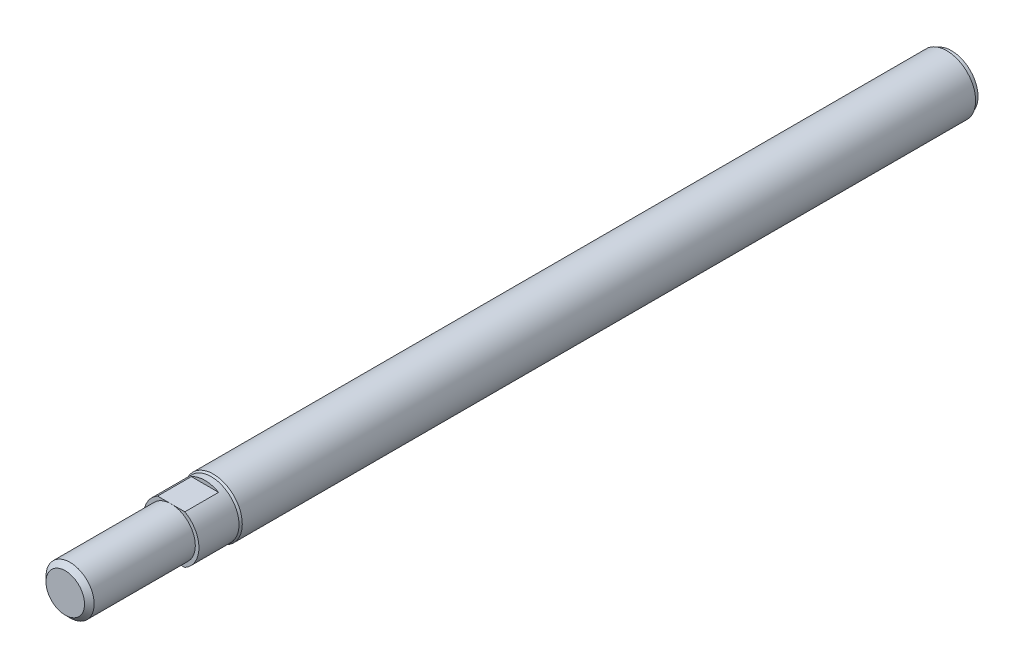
ISO-10303-21;
HEADER;
FILE_DESCRIPTION(('STEP AP214'),'2;1');
FILE_NAME('part.step','',(''),(''),'','','');
FILE_SCHEMA(('AUTOMOTIVE_DESIGN { 1 0 10303 214 1 1 1 1 }'));
ENDSEC;
DATA;
#1=APPLICATION_CONTEXT('core data for automotive mechanical design processes');
#2=APPLICATION_PROTOCOL_DEFINITION('international standard','automotive_design',2000,#1);
#3=PRODUCT_CONTEXT('',#1,'mechanical');
#4=PRODUCT('Part','Part','',(#3));
#5=PRODUCT_RELATED_PRODUCT_CATEGORY('part','',(#4));
#6=PRODUCT_DEFINITION_FORMATION('','',#4);
#7=PRODUCT_DEFINITION_CONTEXT('part definition',#1,'design');
#8=PRODUCT_DEFINITION('design','',#6,#7);
#9=PRODUCT_DEFINITION_SHAPE('','',#8);
#10=(LENGTH_UNIT() NAMED_UNIT(*) SI_UNIT(.MILLI.,.METRE.));
#11=(NAMED_UNIT(*) PLANE_ANGLE_UNIT() SI_UNIT($,.RADIAN.));
#12=(NAMED_UNIT(*) SI_UNIT($,.STERADIAN.) SOLID_ANGLE_UNIT());
#13=UNCERTAINTY_MEASURE_WITH_UNIT(LENGTH_MEASURE(1.E-05),#10,'distance_accuracy_value','');
#14=(GEOMETRIC_REPRESENTATION_CONTEXT(3) GLOBAL_UNCERTAINTY_ASSIGNED_CONTEXT((#13)) GLOBAL_UNIT_ASSIGNED_CONTEXT((#10,
#11,#12)) REPRESENTATION_CONTEXT('',''));
#15=CARTESIAN_POINT('',(0.,0.,0.));
#16=DIRECTION('',(0.,0.,1.));
#17=DIRECTION('',(1.,0.,0.));
#18=AXIS2_PLACEMENT_3D('',#15,#16,#17);
#19=CARTESIAN_POINT('',(0.,0.,184.));
#20=DIRECTION('',(0.,0.,-1.));
#21=DIRECTION('',(-1.,0.,0.));
#22=AXIS2_PLACEMENT_3D('',#19,#20,#21);
#23=CYLINDRICAL_SURFACE('',#22,6.);
#24=CARTESIAN_POINT('',(0.,0.,153.25));
#25=DIRECTION('',(0.,0.,1.));
#26=DIRECTION('',(1.,0.,0.));
#27=AXIS2_PLACEMENT_3D('',#24,#25,#26);
#28=CIRCLE('',#27,6.);
#29=CARTESIAN_POINT('',(6.,0.,153.25));
#30=VERTEX_POINT('',#29);
#31=EDGE_CURVE('E51',#30,#30,#28,.F.);
#32=ORIENTED_EDGE('',*,*,#31,.T.);
#33=EDGE_LOOP('',(#32));
#34=FACE_BOUND('',#33,.T.);
#35=CARTESIAN_POINT('',(0.,0.,1.));
#36=DIRECTION('',(0.,0.,-1.));
#37=DIRECTION('',(-1.,0.,0.));
#38=AXIS2_PLACEMENT_3D('',#35,#36,#37);
#39=CIRCLE('',#38,6.);
#40=CARTESIAN_POINT('',(-6.,0.,1.));
#41=VERTEX_POINT('',#40);
#42=EDGE_CURVE('E116',#41,#41,#39,.T.);
#43=ORIENTED_EDGE('',*,*,#42,.F.);
#44=EDGE_LOOP('',(#43));
#45=FACE_BOUND('',#44,.T.);
#46=ADVANCED_FACE('F43',(#34,#45),#23,.T.);
#47=CARTESIAN_POINT('',(0.,0.,1.));
#48=DIRECTION('',(0.,0.,-1.));
#49=DIRECTION('',(-1.,0.,0.));
#50=AXIS2_PLACEMENT_3D('',#47,#48,#49);
#51=PLANE('',#50);
#52=CARTESIAN_POINT('',(0.,0.,1.));
#53=DIRECTION('',(0.,0.,-1.));
#54=DIRECTION('',(-1.,0.,0.));
#55=AXIS2_PLACEMENT_3D('',#52,#53,#54);
#56=CIRCLE('',#55,5.5);
#57=CARTESIAN_POINT('',(-5.5,0.,1.));
#58=VERTEX_POINT('',#57);
#59=EDGE_CURVE('E120',#58,#58,#56,.T.);
#60=ORIENTED_EDGE('',*,*,#59,.F.);
#61=EDGE_LOOP('',(#60));
#62=FACE_BOUND('',#61,.T.);
#63=ORIENTED_EDGE('',*,*,#42,.T.);
#64=EDGE_LOOP('',(#63));
#65=FACE_BOUND('',#64,.T.);
#66=ADVANCED_FACE('F148',(#62,#65),#51,.T.);
#67=CARTESIAN_POINT('',(0.,0.,1.));
#68=DIRECTION('',(0.,0.,-1.));
#69=DIRECTION('',(-1.,0.,0.));
#70=AXIS2_PLACEMENT_3D('',#67,#68,#69);
#71=CYLINDRICAL_SURFACE('',#70,5.5);
#72=ORIENTED_EDGE('',*,*,#59,.T.);
#73=EDGE_LOOP('',(#72));
#74=FACE_BOUND('',#73,.T.);
#75=CARTESIAN_POINT('',(0.,0.,0.));
#76=DIRECTION('',(0.,0.,-1.));
#77=DIRECTION('',(-1.,0.,0.));
#78=AXIS2_PLACEMENT_3D('',#75,#76,#77);
#79=CIRCLE('',#78,5.5);
#80=CARTESIAN_POINT('',(-5.5,0.,0.));
#81=VERTEX_POINT('',#80);
#82=EDGE_CURVE('E180',#81,#81,#79,.T.);
#83=ORIENTED_EDGE('',*,*,#82,.F.);
#84=EDGE_LOOP('',(#83));
#85=FACE_BOUND('',#84,.T.);
#86=ADVANCED_FACE('F154',(#74,#85),#71,.T.);
#87=CARTESIAN_POINT('',(0.,0.,0.));
#88=DIRECTION('',(0.,0.,1.));
#89=DIRECTION('',(1.,0.,0.));
#90=AXIS2_PLACEMENT_3D('',#87,#88,#89);
#91=PLANE('',#90);
#92=CARTESIAN_POINT('',(0.,0.,0.));
#93=DIRECTION('',(0.,0.,-1.));
#94=DIRECTION('',(-1.,0.,0.));
#95=AXIS2_PLACEMENT_3D('',#92,#93,#94);
#96=CIRCLE('',#95,2.5);
#97=CARTESIAN_POINT('',(-2.5,0.,0.));
#98=VERTEX_POINT('',#97);
#99=EDGE_CURVE('E188',#98,#98,#96,.T.);
#100=ORIENTED_EDGE('',*,*,#99,.F.);
#101=EDGE_LOOP('',(#100));
#102=FACE_BOUND('',#101,.T.);
#103=ORIENTED_EDGE('',*,*,#82,.T.);
#104=EDGE_LOOP('',(#103));
#105=FACE_BOUND('',#104,.T.);
#106=ADVANCED_FACE('F158',(#102,#105),#91,.F.);
#107=CARTESIAN_POINT('',(0.,0.,17.));
#108=DIRECTION('',(0.,0.,-1.));
#109=DIRECTION('',(-1.,0.,0.));
#110=AXIS2_PLACEMENT_3D('',#107,#108,#109);
#111=CONICAL_SURFACE('',#110,2.49999999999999,1.02974425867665);
#112=CARTESIAN_POINT('',(0.,0.,18.5021515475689));
#113=VERTEX_POINT('',#112);
#114=VERTEX_LOOP('',#113);
#115=FACE_BOUND('',#114,.T.);
#116=CARTESIAN_POINT('',(0.,0.,17.));
#117=DIRECTION('',(0.,0.,-1.));
#118=DIRECTION('',(-1.,0.,0.));
#119=AXIS2_PLACEMENT_3D('',#116,#117,#118);
#120=CIRCLE('',#119,2.49999999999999);
#121=CARTESIAN_POINT('',(-2.49999999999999,0.,17.));
#122=VERTEX_POINT('',#121);
#123=EDGE_CURVE('E183',#122,#122,#120,.T.);
#124=ORIENTED_EDGE('',*,*,#123,.T.);
#125=EDGE_LOOP('',(#124));
#126=FACE_BOUND('',#125,.T.);
#127=ADVANCED_FACE('F144',(#115,#126),#111,.F.);
#128=CARTESIAN_POINT('',(0.,0.,0.));
#129=DIRECTION('',(0.,0.,-1.));
#130=DIRECTION('',(-1.,0.,0.));
#131=AXIS2_PLACEMENT_3D('',#128,#129,#130);
#132=CYLINDRICAL_SURFACE('',#131,2.5);
#133=ORIENTED_EDGE('',*,*,#123,.F.);
#134=EDGE_LOOP('',(#133));
#135=FACE_BOUND('',#134,.T.);
#136=ORIENTED_EDGE('',*,*,#99,.T.);
#137=EDGE_LOOP('',(#136));
#138=FACE_BOUND('',#137,.T.);
#139=ADVANCED_FACE('F134',(#135,#138),#132,.F.);
#140=CARTESIAN_POINT('',(0.,0.,154.));
#141=DIRECTION('',(0.,0.,1.));
#142=DIRECTION('',(1.,0.,0.));
#143=AXIS2_PLACEMENT_3D('',#140,#141,#142);
#144=CYLINDRICAL_SURFACE('',#143,5.75);
#145=CARTESIAN_POINT('',(0.,0.,153.683012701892));
#146=DIRECTION('',(0.,0.,-1.));
#147=DIRECTION('',(-1.,0.,0.));
#148=AXIS2_PLACEMENT_3D('',#145,#146,#147);
#149=CIRCLE('',#148,5.75);
#150=CARTESIAN_POINT('',(-5.75,0.,153.683012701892));
#151=VERTEX_POINT('',#150);
#152=EDGE_CURVE('E12',#151,#151,#149,.F.);
#153=ORIENTED_EDGE('',*,*,#152,.T.);
#154=EDGE_LOOP('',(#153));
#155=FACE_BOUND('',#154,.T.);
#156=CARTESIAN_POINT('',(0.,0.,155.));
#157=DIRECTION('',(0.,0.,1.));
#158=DIRECTION('',(1.,0.,0.));
#159=AXIS2_PLACEMENT_3D('',#156,#157,#158);
#160=CIRCLE('',#159,5.75);
#161=CARTESIAN_POINT('',(2.83063155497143,5.005,155.));
#162=VERTEX_POINT('',#161);
#163=CARTESIAN_POINT('',(-2.83063155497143,5.005,155.));
#164=VERTEX_POINT('',#163);
#165=EDGE_CURVE('E88',#162,#164,#160,.T.);
#166=ORIENTED_EDGE('',*,*,#165,.F.);
#167=DIRECTION('',(0.,0.,1.));
#168=VECTOR('',#167,1.);
#169=CARTESIAN_POINT('',(2.83063155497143,5.005,154.));
#170=LINE('',#169,#168);
#171=CARTESIAN_POINT('',(2.83063155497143,5.005,162.));
#172=VERTEX_POINT('',#171);
#173=EDGE_CURVE('E82',#172,#162,#170,.F.);
#174=ORIENTED_EDGE('',*,*,#173,.F.);
#175=CARTESIAN_POINT('',(0.,0.,162.));
#176=DIRECTION('',(0.,0.,1.));
#177=DIRECTION('',(1.,0.,0.));
#178=AXIS2_PLACEMENT_3D('',#175,#176,#177);
#179=CIRCLE('',#178,5.75);
#180=CARTESIAN_POINT('',(2.83063155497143,-5.005,162.));
#181=VERTEX_POINT('',#180);
#182=EDGE_CURVE('E85',#181,#172,#179,.T.);
#183=ORIENTED_EDGE('',*,*,#182,.F.);
#184=DIRECTION('',(0.,0.,1.));
#185=VECTOR('',#184,1.);
#186=CARTESIAN_POINT('',(2.83063155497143,-5.005,154.));
#187=LINE('',#186,#185);
#188=CARTESIAN_POINT('',(2.83063155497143,-5.005,155.));
#189=VERTEX_POINT('',#188);
#190=EDGE_CURVE('E122',#189,#181,#187,.T.);
#191=ORIENTED_EDGE('',*,*,#190,.F.);
#192=CARTESIAN_POINT('',(0.,0.,155.));
#193=DIRECTION('',(0.,0.,1.));
#194=DIRECTION('',(1.,0.,0.));
#195=AXIS2_PLACEMENT_3D('',#192,#193,#194);
#196=CIRCLE('',#195,5.75);
#197=CARTESIAN_POINT('',(-2.83063155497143,-5.005,155.));
#198=VERTEX_POINT('',#197);
#199=EDGE_CURVE('E58',#198,#189,#196,.T.);
#200=ORIENTED_EDGE('',*,*,#199,.F.);
#201=DIRECTION('',(0.,0.,1.));
#202=VECTOR('',#201,1.);
#203=CARTESIAN_POINT('',(-2.83063155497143,-5.005,154.));
#204=LINE('',#203,#202);
#205=CARTESIAN_POINT('',(-2.83063155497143,-5.005,162.));
#206=VERTEX_POINT('',#205);
#207=EDGE_CURVE('E109',#206,#198,#204,.F.);
#208=ORIENTED_EDGE('',*,*,#207,.F.);
#209=CARTESIAN_POINT('',(-2.83063155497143,5.005,162.));
#210=VERTEX_POINT('',#209);
#211=EDGE_CURVE('E103',#210,#206,#179,.T.);
#212=ORIENTED_EDGE('',*,*,#211,.F.);
#213=DIRECTION('',(0.,0.,1.));
#214=VECTOR('',#213,1.);
#215=CARTESIAN_POINT('',(-2.83063155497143,5.005,154.));
#216=LINE('',#215,#214);
#217=EDGE_CURVE('E93',#164,#210,#216,.T.);
#218=ORIENTED_EDGE('',*,*,#217,.F.);
#219=EDGE_LOOP('',(#166,#174,#183,#191,#200,#208,#212,#218));
#220=FACE_BOUND('',#219,.T.);
#221=ADVANCED_FACE('F84',(#155,#220),#144,.T.);
#222=CARTESIAN_POINT('',(0.,0.,184.));
#223=DIRECTION('',(0.,0.,1.));
#224=DIRECTION('',(1.,0.,0.));
#225=AXIS2_PLACEMENT_3D('',#222,#223,#224);
#226=PLANE('',#225);
#227=CARTESIAN_POINT('',(0.,0.,184.));
#228=DIRECTION('',(0.,0.,1.));
#229=DIRECTION('',(1.,0.,0.));
#230=AXIS2_PLACEMENT_3D('',#227,#228,#229);
#231=CIRCLE('',#230,4.00000000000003);
#232=CARTESIAN_POINT('',(4.00000000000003,0.,184.));
#233=VERTEX_POINT('',#232);
#234=EDGE_CURVE('E112',#233,#233,#231,.T.);
#235=ORIENTED_EDGE('',*,*,#234,.T.);
#236=EDGE_LOOP('',(#235));
#237=FACE_BOUND('',#236,.T.);
#238=ADVANCED_FACE('F133',(#237),#226,.T.);
#239=CARTESIAN_POINT('',(0.,0.,184.));
#240=DIRECTION('',(0.,0.,-1.));
#241=DIRECTION('',(-1.,0.,0.));
#242=AXIS2_PLACEMENT_3D('',#239,#240,#241);
#243=CONICAL_SURFACE('',#242,4.00000000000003,0.785398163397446);
#244=CARTESIAN_POINT('',(0.,0.,183.));
#245=DIRECTION('',(0.,0.,1.));
#246=DIRECTION('',(1.,0.,0.));
#247=AXIS2_PLACEMENT_3D('',#244,#245,#246);
#248=CIRCLE('',#247,5.);
#249=CARTESIAN_POINT('',(5.,0.,183.));
#250=VERTEX_POINT('',#249);
#251=EDGE_CURVE('E107',#250,#250,#248,.F.);
#252=ORIENTED_EDGE('',*,*,#251,.F.);
#253=EDGE_LOOP('',(#252));
#254=FACE_BOUND('',#253,.T.);
#255=ORIENTED_EDGE('',*,*,#234,.F.);
#256=EDGE_LOOP('',(#255));
#257=FACE_BOUND('',#256,.T.);
#258=ADVANCED_FACE('F140',(#254,#257),#243,.T.);
#259=CARTESIAN_POINT('',(0.,0.,162.));
#260=DIRECTION('',(0.,0.,1.));
#261=DIRECTION('',(1.,0.,0.));
#262=AXIS2_PLACEMENT_3D('',#259,#260,#261);
#263=CYLINDRICAL_SURFACE('',#262,5.);
#264=ORIENTED_EDGE('',*,*,#251,.T.);
#265=EDGE_LOOP('',(#264));
#266=FACE_BOUND('',#265,.T.);
#267=CARTESIAN_POINT('',(0.,0.,162.));
#268=DIRECTION('',(0.,0.,1.));
#269=DIRECTION('',(1.,0.,0.));
#270=AXIS2_PLACEMENT_3D('',#267,#268,#269);
#271=CIRCLE('',#270,5.);
#272=CARTESIAN_POINT('',(5.,0.,162.));
#273=VERTEX_POINT('',#272);
#274=EDGE_CURVE('E172',#273,#273,#271,.T.);
#275=ORIENTED_EDGE('',*,*,#274,.T.);
#276=EDGE_LOOP('',(#275));
#277=FACE_BOUND('',#276,.T.);
#278=ADVANCED_FACE('F160',(#266,#277),#263,.T.);
#279=CARTESIAN_POINT('',(-9.11950198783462,-5.005,155.));
#280=DIRECTION('',(0.,-1.,0.));
#281=DIRECTION('',(0.,0.,-1.));
#282=AXIS2_PLACEMENT_3D('',#279,#280,#281);
#283=PLANE('',#282);
#284=DIRECTION('',(1.,0.,0.));
#285=VECTOR('',#284,1.);
#286=CARTESIAN_POINT('',(-9.11950198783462,-5.005,155.));
#287=LINE('',#286,#285);
#288=EDGE_CURVE('E174',#198,#189,#287,.T.);
#289=ORIENTED_EDGE('',*,*,#288,.T.);
#290=ORIENTED_EDGE('',*,*,#190,.T.);
#291=DIRECTION('',(1.,0.,0.));
#292=VECTOR('',#291,1.);
#293=CARTESIAN_POINT('',(0.,-5.005,162.));
#294=LINE('',#293,#292);
#295=EDGE_CURVE('E102',#206,#181,#294,.T.);
#296=ORIENTED_EDGE('',*,*,#295,.F.);
#297=ORIENTED_EDGE('',*,*,#207,.T.);
#298=EDGE_LOOP('',(#289,#290,#296,#297));
#299=FACE_BOUND('',#298,.T.);
#300=ADVANCED_FACE('F165',(#299),#283,.T.);
#301=CARTESIAN_POINT('',(0.,0.,155.));
#302=DIRECTION('',(0.,0.,1.));
#303=DIRECTION('',(1.,0.,0.));
#304=AXIS2_PLACEMENT_3D('',#301,#302,#303);
#305=PLANE('',#304);
#306=ORIENTED_EDGE('',*,*,#288,.F.);
#307=ORIENTED_EDGE('',*,*,#199,.T.);
#308=EDGE_LOOP('',(#306,#307));
#309=FACE_BOUND('',#308,.T.);
#310=ADVANCED_FACE('F196',(#309),#305,.T.);
#311=DIRECTION('',(-1.,0.,0.));
#312=VECTOR('',#311,1.);
#313=CARTESIAN_POINT('',(-9.11950198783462,5.005,155.));
#314=LINE('',#313,#312);
#315=EDGE_CURVE('E119',#162,#164,#314,.T.);
#316=ORIENTED_EDGE('',*,*,#315,.F.);
#317=ORIENTED_EDGE('',*,*,#165,.T.);
#318=EDGE_LOOP('',(#316,#317));
#319=FACE_BOUND('',#318,.T.);
#320=ADVANCED_FACE('F198',(#319),#305,.T.);
#321=CARTESIAN_POINT('',(-9.11950198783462,5.005,155.));
#322=DIRECTION('',(0.,1.,0.));
#323=DIRECTION('',(0.,0.,1.));
#324=AXIS2_PLACEMENT_3D('',#321,#322,#323);
#325=PLANE('',#324);
#326=ORIENTED_EDGE('',*,*,#315,.T.);
#327=ORIENTED_EDGE('',*,*,#217,.T.);
#328=DIRECTION('',(-1.,0.,0.));
#329=VECTOR('',#328,1.);
#330=CARTESIAN_POINT('',(0.,5.005,162.));
#331=LINE('',#330,#329);
#332=EDGE_CURVE('E100',#172,#210,#331,.T.);
#333=ORIENTED_EDGE('',*,*,#332,.F.);
#334=ORIENTED_EDGE('',*,*,#173,.T.);
#335=EDGE_LOOP('',(#326,#327,#333,#334));
#336=FACE_BOUND('',#335,.T.);
#337=ADVANCED_FACE('F106',(#336),#325,.T.);
#338=CARTESIAN_POINT('',(0.,0.,162.));
#339=DIRECTION('',(0.,0.,1.));
#340=DIRECTION('',(1.,0.,0.));
#341=AXIS2_PLACEMENT_3D('',#338,#339,#340);
#342=PLANE('',#341);
#343=ORIENTED_EDGE('',*,*,#274,.F.);
#344=EDGE_LOOP('',(#343));
#345=FACE_BOUND('',#344,.T.);
#346=ORIENTED_EDGE('',*,*,#332,.T.);
#347=ORIENTED_EDGE('',*,*,#211,.T.);
#348=ORIENTED_EDGE('',*,*,#295,.T.);
#349=ORIENTED_EDGE('',*,*,#182,.T.);
#350=EDGE_LOOP('',(#346,#347,#348,#349));
#351=FACE_BOUND('',#350,.T.);
#352=ADVANCED_FACE('F98',(#345,#351),#342,.T.);
#353=CARTESIAN_POINT('',(0.,0.,154.));
#354=DIRECTION('',(0.,0.,-1.));
#355=DIRECTION('',(-1.,0.,0.));
#356=AXIS2_PLACEMENT_3D('',#353,#354,#355);
#357=CONICAL_SURFACE('',#356,5.56698729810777,0.523598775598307);
#358=ORIENTED_EDGE('',*,*,#31,.F.);
#359=EDGE_LOOP('',(#358));
#360=FACE_BOUND('',#359,.T.);
#361=ORIENTED_EDGE('',*,*,#152,.F.);
#362=EDGE_LOOP('',(#361));
#363=FACE_BOUND('',#362,.T.);
#364=ADVANCED_FACE('F45',(#360,#363),#357,.T.);
#365=CLOSED_SHELL('',(#46,#66,#86,#106,#127,#139,#221,#238,#258,#278,#300,#310,#320,#337,#352,#364));
#366=MANIFOLD_SOLID_BREP('B2',#365);
#367=ADVANCED_BREP_SHAPE_REPRESENTATION('',(#18,#366),#14);
#368=SHAPE_DEFINITION_REPRESENTATION(#9,#367);
ENDSEC;
END-ISO-10303-21;
